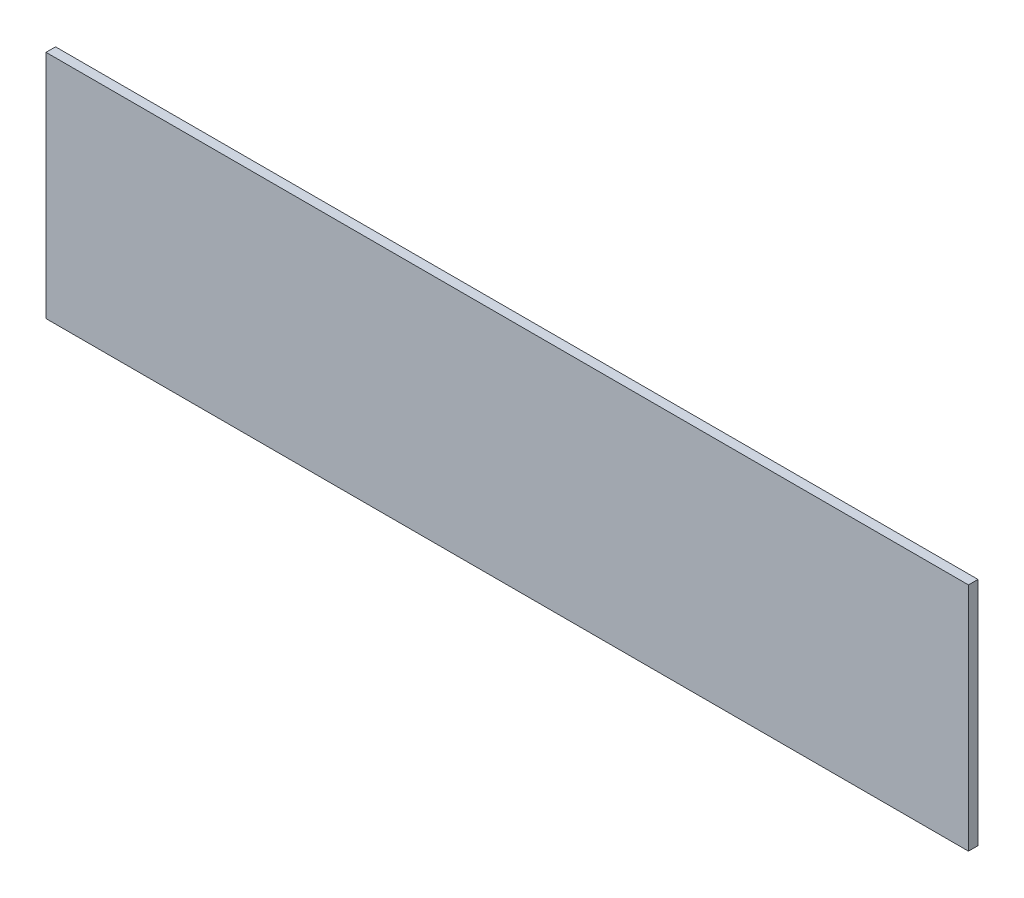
ISO-10303-21;
HEADER;
FILE_DESCRIPTION(('STEP AP214'),'2;1');
FILE_NAME('part.step','',(''),(''),'','','');
FILE_SCHEMA(('AUTOMOTIVE_DESIGN { 1 0 10303 214 1 1 1 1 }'));
ENDSEC;
DATA;
#1=APPLICATION_CONTEXT('core data for automotive mechanical design processes');
#2=APPLICATION_PROTOCOL_DEFINITION('international standard','automotive_design',2000,#1);
#3=PRODUCT_CONTEXT('',#1,'mechanical');
#4=PRODUCT('Part','Part','',(#3));
#5=PRODUCT_RELATED_PRODUCT_CATEGORY('part','',(#4));
#6=PRODUCT_DEFINITION_FORMATION('','',#4);
#7=PRODUCT_DEFINITION_CONTEXT('part definition',#1,'design');
#8=PRODUCT_DEFINITION('design','',#6,#7);
#9=PRODUCT_DEFINITION_SHAPE('','',#8);
#10=(LENGTH_UNIT() NAMED_UNIT(*) SI_UNIT(.MILLI.,.METRE.));
#11=(NAMED_UNIT(*) PLANE_ANGLE_UNIT() SI_UNIT($,.RADIAN.));
#12=(NAMED_UNIT(*) SI_UNIT($,.STERADIAN.) SOLID_ANGLE_UNIT());
#13=UNCERTAINTY_MEASURE_WITH_UNIT(LENGTH_MEASURE(1.E-05),#10,'distance_accuracy_value','');
#14=(GEOMETRIC_REPRESENTATION_CONTEXT(3) GLOBAL_UNCERTAINTY_ASSIGNED_CONTEXT((#13)) GLOBAL_UNIT_ASSIGNED_CONTEXT((#10,
#11,#12)) REPRESENTATION_CONTEXT('',''));
#15=CARTESIAN_POINT('',(0.,0.,0.));
#16=DIRECTION('',(0.,0.,1.));
#17=DIRECTION('',(1.,0.,0.));
#18=AXIS2_PLACEMENT_3D('',#15,#16,#17);
#19=CARTESIAN_POINT('',(0.,0.,10.));
#20=DIRECTION('',(1.,0.,0.));
#21=DIRECTION('',(0.,0.,-1.));
#22=AXIS2_PLACEMENT_3D('',#19,#20,#21);
#23=PLANE('',#22);
#24=DIRECTION('',(0.,-1.,0.));
#25=VECTOR('',#24,1.);
#26=CARTESIAN_POINT('',(0.,0.,0.));
#27=LINE('',#26,#25);
#28=CARTESIAN_POINT('',(0.,242.,0.));
#29=VERTEX_POINT('',#28);
#30=CARTESIAN_POINT('',(0.,0.,0.));
#31=VERTEX_POINT('',#30);
#32=EDGE_CURVE('E98',#29,#31,#27,.T.);
#33=ORIENTED_EDGE('',*,*,#32,.T.);
#34=DIRECTION('',(0.,0.,-1.));
#35=VECTOR('',#34,1.);
#36=CARTESIAN_POINT('',(0.,0.,10.));
#37=LINE('',#36,#35);
#38=CARTESIAN_POINT('',(0.,0.,10.));
#39=VERTEX_POINT('',#38);
#40=EDGE_CURVE('E11',#39,#31,#37,.T.);
#41=ORIENTED_EDGE('',*,*,#40,.F.);
#42=DIRECTION('',(0.,-1.,0.));
#43=VECTOR('',#42,1.);
#44=CARTESIAN_POINT('',(0.,0.,10.));
#45=LINE('',#44,#43);
#46=CARTESIAN_POINT('',(0.,242.,10.));
#47=VERTEX_POINT('',#46);
#48=EDGE_CURVE('E86',#47,#39,#45,.T.);
#49=ORIENTED_EDGE('',*,*,#48,.F.);
#50=DIRECTION('',(0.,0.,-1.));
#51=VECTOR('',#50,1.);
#52=CARTESIAN_POINT('',(0.,242.,10.));
#53=LINE('',#52,#51);
#54=EDGE_CURVE('E94',#47,#29,#53,.T.);
#55=ORIENTED_EDGE('',*,*,#54,.T.);
#56=EDGE_LOOP('',(#33,#41,#49,#55));
#57=FACE_BOUND('',#56,.T.);
#58=ADVANCED_FACE('F35',(#57),#23,.F.);
#59=CARTESIAN_POINT('',(0.,0.,10.));
#60=DIRECTION('',(0.,1.,0.));
#61=DIRECTION('',(0.,0.,1.));
#62=AXIS2_PLACEMENT_3D('',#59,#60,#61);
#63=PLANE('',#62);
#64=DIRECTION('',(1.,0.,0.));
#65=VECTOR('',#64,1.);
#66=CARTESIAN_POINT('',(0.,0.,0.));
#67=LINE('',#66,#65);
#68=CARTESIAN_POINT('',(968.,0.,0.));
#69=VERTEX_POINT('',#68);
#70=EDGE_CURVE('E90',#31,#69,#67,.T.);
#71=ORIENTED_EDGE('',*,*,#70,.T.);
#72=DIRECTION('',(0.,0.,-1.));
#73=VECTOR('',#72,1.);
#74=CARTESIAN_POINT('',(968.,0.,10.));
#75=LINE('',#74,#73);
#76=CARTESIAN_POINT('',(968.,0.,10.));
#77=VERTEX_POINT('',#76);
#78=EDGE_CURVE('E43',#77,#69,#75,.T.);
#79=ORIENTED_EDGE('',*,*,#78,.F.);
#80=DIRECTION('',(1.,0.,0.));
#81=VECTOR('',#80,1.);
#82=CARTESIAN_POINT('',(0.,0.,10.));
#83=LINE('',#82,#81);
#84=EDGE_CURVE('E81',#39,#77,#83,.T.);
#85=ORIENTED_EDGE('',*,*,#84,.F.);
#86=ORIENTED_EDGE('',*,*,#40,.T.);
#87=EDGE_LOOP('',(#71,#79,#85,#86));
#88=FACE_BOUND('',#87,.T.);
#89=ADVANCED_FACE('F89',(#88),#63,.F.);
#90=CARTESIAN_POINT('',(968.,0.,10.));
#91=DIRECTION('',(-1.,0.,0.));
#92=DIRECTION('',(0.,0.,1.));
#93=AXIS2_PLACEMENT_3D('',#90,#91,#92);
#94=PLANE('',#93);
#95=DIRECTION('',(0.,1.,0.));
#96=VECTOR('',#95,1.);
#97=CARTESIAN_POINT('',(968.,0.,0.));
#98=LINE('',#97,#96);
#99=CARTESIAN_POINT('',(968.,242.,0.));
#100=VERTEX_POINT('',#99);
#101=EDGE_CURVE('E68',#69,#100,#98,.T.);
#102=ORIENTED_EDGE('',*,*,#101,.T.);
#103=DIRECTION('',(0.,0.,-1.));
#104=VECTOR('',#103,1.);
#105=CARTESIAN_POINT('',(968.,242.,10.));
#106=LINE('',#105,#104);
#107=CARTESIAN_POINT('',(968.,242.,10.));
#108=VERTEX_POINT('',#107);
#109=EDGE_CURVE('E91',#108,#100,#106,.T.);
#110=ORIENTED_EDGE('',*,*,#109,.F.);
#111=DIRECTION('',(0.,1.,0.));
#112=VECTOR('',#111,1.);
#113=CARTESIAN_POINT('',(968.,0.,10.));
#114=LINE('',#113,#112);
#115=EDGE_CURVE('E84',#77,#108,#114,.T.);
#116=ORIENTED_EDGE('',*,*,#115,.F.);
#117=ORIENTED_EDGE('',*,*,#78,.T.);
#118=EDGE_LOOP('',(#102,#110,#116,#117));
#119=FACE_BOUND('',#118,.T.);
#120=ADVANCED_FACE('F92',(#119),#94,.F.);
#121=CARTESIAN_POINT('',(0.,242.,10.));
#122=DIRECTION('',(0.,-1.,0.));
#123=DIRECTION('',(0.,0.,-1.));
#124=AXIS2_PLACEMENT_3D('',#121,#122,#123);
#125=PLANE('',#124);
#126=DIRECTION('',(-1.,0.,0.));
#127=VECTOR('',#126,1.);
#128=CARTESIAN_POINT('',(0.,242.,0.));
#129=LINE('',#128,#127);
#130=EDGE_CURVE('E74',#100,#29,#129,.T.);
#131=ORIENTED_EDGE('',*,*,#130,.T.);
#132=ORIENTED_EDGE('',*,*,#54,.F.);
#133=DIRECTION('',(-1.,0.,0.));
#134=VECTOR('',#133,1.);
#135=CARTESIAN_POINT('',(0.,242.,10.));
#136=LINE('',#135,#134);
#137=EDGE_CURVE('E51',#108,#47,#136,.T.);
#138=ORIENTED_EDGE('',*,*,#137,.F.);
#139=ORIENTED_EDGE('',*,*,#109,.T.);
#140=EDGE_LOOP('',(#131,#132,#138,#139));
#141=FACE_BOUND('',#140,.T.);
#142=ADVANCED_FACE('F105',(#141),#125,.F.);
#143=CARTESIAN_POINT('',(0.,0.,10.));
#144=DIRECTION('',(0.,0.,-1.));
#145=DIRECTION('',(-1.,0.,0.));
#146=AXIS2_PLACEMENT_3D('',#143,#144,#145);
#147=PLANE('',#146);
#148=ORIENTED_EDGE('',*,*,#48,.T.);
#149=ORIENTED_EDGE('',*,*,#84,.T.);
#150=ORIENTED_EDGE('',*,*,#115,.T.);
#151=ORIENTED_EDGE('',*,*,#137,.T.);
#152=EDGE_LOOP('',(#148,#149,#150,#151));
#153=FACE_BOUND('',#152,.T.);
#154=ADVANCED_FACE('F82',(#153),#147,.F.);
#155=CARTESIAN_POINT('',(0.,0.,0.));
#156=DIRECTION('',(0.,0.,-1.));
#157=DIRECTION('',(-1.,0.,0.));
#158=AXIS2_PLACEMENT_3D('',#155,#156,#157);
#159=PLANE('',#158);
#160=ORIENTED_EDGE('',*,*,#32,.F.);
#161=ORIENTED_EDGE('',*,*,#130,.F.);
#162=ORIENTED_EDGE('',*,*,#101,.F.);
#163=ORIENTED_EDGE('',*,*,#70,.F.);
#164=EDGE_LOOP('',(#160,#161,#162,#163));
#165=FACE_BOUND('',#164,.T.);
#166=ADVANCED_FACE('F108',(#165),#159,.T.);
#167=CLOSED_SHELL('',(#58,#89,#120,#142,#154,#166));
#168=MANIFOLD_SOLID_BREP('B2',#167);
#169=ADVANCED_BREP_SHAPE_REPRESENTATION('',(#18,#168),#14);
#170=SHAPE_DEFINITION_REPRESENTATION(#9,#169);
ENDSEC;
END-ISO-10303-21;
